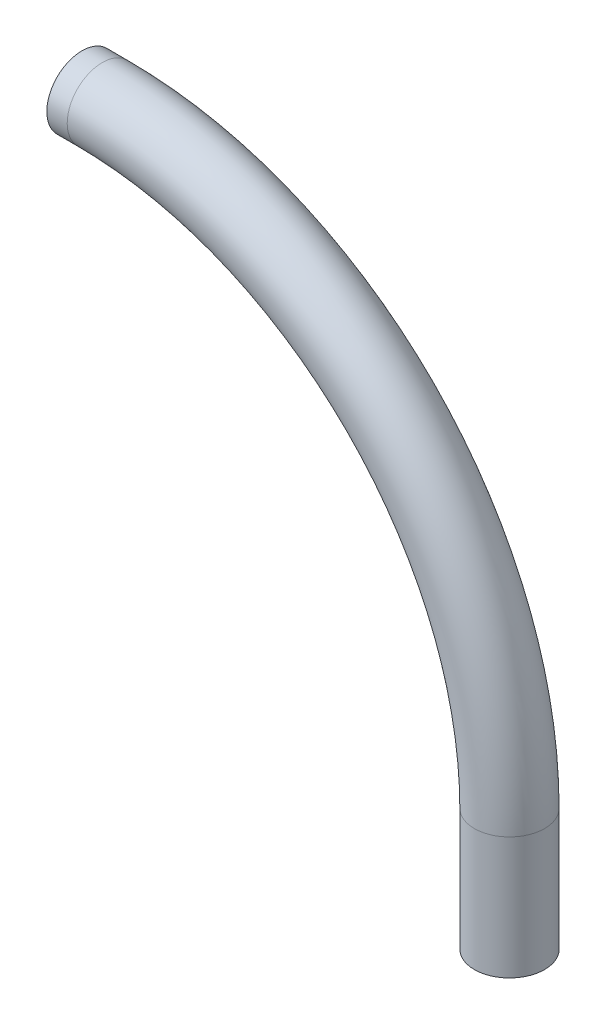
ISO-10303-21;
HEADER;
FILE_DESCRIPTION(('STEP AP214'),'2;1');
FILE_NAME('part.step','',(''),(''),'','','');
FILE_SCHEMA(('AUTOMOTIVE_DESIGN { 1 0 10303 214 1 1 1 1 }'));
ENDSEC;
DATA;
#1=APPLICATION_CONTEXT('core data for automotive mechanical design processes');
#2=APPLICATION_PROTOCOL_DEFINITION('international standard','automotive_design',2000,#1);
#3=PRODUCT_CONTEXT('',#1,'mechanical');
#4=PRODUCT('Part','Part','',(#3));
#5=PRODUCT_RELATED_PRODUCT_CATEGORY('part','',(#4));
#6=PRODUCT_DEFINITION_FORMATION('','',#4);
#7=PRODUCT_DEFINITION_CONTEXT('part definition',#1,'design');
#8=PRODUCT_DEFINITION('design','',#6,#7);
#9=PRODUCT_DEFINITION_SHAPE('','',#8);
#10=(LENGTH_UNIT() NAMED_UNIT(*) SI_UNIT(.MILLI.,.METRE.));
#11=(NAMED_UNIT(*) PLANE_ANGLE_UNIT() SI_UNIT($,.RADIAN.));
#12=(NAMED_UNIT(*) SI_UNIT($,.STERADIAN.) SOLID_ANGLE_UNIT());
#13=UNCERTAINTY_MEASURE_WITH_UNIT(LENGTH_MEASURE(1.E-05),#10,'distance_accuracy_value','');
#14=(GEOMETRIC_REPRESENTATION_CONTEXT(3) GLOBAL_UNCERTAINTY_ASSIGNED_CONTEXT((#13)) GLOBAL_UNIT_ASSIGNED_CONTEXT((#10,
#11,#12)) REPRESENTATION_CONTEXT('',''));
#15=CARTESIAN_POINT('',(0.,0.,0.));
#16=DIRECTION('',(0.,0.,1.));
#17=DIRECTION('',(1.,0.,0.));
#18=AXIS2_PLACEMENT_3D('',#15,#16,#17);
#19=CARTESIAN_POINT('',(-200.,60.,0.));
#20=DIRECTION('',(0.,0.,1.));
#21=DIRECTION('',(1.,0.,0.));
#22=AXIS2_PLACEMENT_3D('',#19,#20,#21);
#23=TOROIDAL_SURFACE('',#22,200.,14.5);
#24=CARTESIAN_POINT('',(0.,60.,0.));
#25=DIRECTION('',(0.,1.,0.));
#26=DIRECTION('',(0.,0.,1.));
#27=AXIS2_PLACEMENT_3D('',#24,#25,#26);
#28=CIRCLE('',#27,14.5);
#29=CARTESIAN_POINT('',(14.5,60.,0.));
#30=VERTEX_POINT('',#29);
#31=EDGE_CURVE('E31',#30,#30,#28,.F.);
#32=CARTESIAN_POINT('',(-200.,260.,0.));
#33=DIRECTION('',(-1.,0.,0.));
#34=DIRECTION('',(0.,-1.,0.));
#35=AXIS2_PLACEMENT_3D('',#32,#33,#34);
#36=CIRCLE('',#35,14.5);
#37=CARTESIAN_POINT('',(-200.,274.5,0.));
#38=VERTEX_POINT('',#37);
#39=EDGE_CURVE('E34',#38,#38,#36,.T.);
#40=CARTESIAN_POINT('',(-200.,60.,0.));
#41=DIRECTION('',(0.,0.,1.));
#42=DIRECTION('',(1.,0.,0.));
#43=AXIS2_PLACEMENT_3D('',#40,#41,#42);
#44=CIRCLE('',#43,214.5);
#45=EDGE_CURVE('',#30,#38,#44,.T.);
#46=ORIENTED_EDGE('',*,*,#31,.T.);
#47=ORIENTED_EDGE('',*,*,#39,.T.);
#48=ORIENTED_EDGE('',*,*,#45,.T.);
#49=ORIENTED_EDGE('',*,*,#45,.F.);
#50=EDGE_LOOP('',(#46,#48,#47,#49));
#51=FACE_BOUND('',#50,.T.);
#52=ADVANCED_FACE('F15',(#51),#23,.F.);
#53=CARTESIAN_POINT('',(-200.,260.,0.));
#54=DIRECTION('',(-1.,0.,0.));
#55=DIRECTION('',(0.,-1.,0.));
#56=AXIS2_PLACEMENT_3D('',#53,#54,#55);
#57=CYLINDRICAL_SURFACE('',#56,14.5);
#58=ORIENTED_EDGE('',*,*,#39,.F.);
#59=EDGE_LOOP('',(#58));
#60=FACE_BOUND('',#59,.T.);
#61=CARTESIAN_POINT('',(-210.,260.,0.));
#62=DIRECTION('',(-1.,0.,0.));
#63=DIRECTION('',(0.,-1.,0.));
#64=AXIS2_PLACEMENT_3D('',#61,#62,#63);
#65=CIRCLE('',#64,14.5);
#66=CARTESIAN_POINT('',(-210.,245.5,0.));
#67=VERTEX_POINT('',#66);
#68=EDGE_CURVE('E19',#67,#67,#65,.F.);
#69=ORIENTED_EDGE('',*,*,#68,.F.);
#70=EDGE_LOOP('',(#69));
#71=FACE_BOUND('',#70,.T.);
#72=ADVANCED_FACE('F51',(#60,#71),#57,.F.);
#73=CARTESIAN_POINT('',(0.,0.,0.));
#74=DIRECTION('',(0.,1.,0.));
#75=DIRECTION('',(0.,0.,1.));
#76=AXIS2_PLACEMENT_3D('',#73,#74,#75);
#77=CYLINDRICAL_SURFACE('',#76,14.5);
#78=ORIENTED_EDGE('',*,*,#31,.F.);
#79=EDGE_LOOP('',(#78));
#80=FACE_BOUND('',#79,.T.);
#81=CARTESIAN_POINT('',(0.,0.,0.));
#82=DIRECTION('',(0.,1.,0.));
#83=DIRECTION('',(0.,0.,1.));
#84=AXIS2_PLACEMENT_3D('',#81,#82,#83);
#85=CIRCLE('',#84,14.5);
#86=CARTESIAN_POINT('',(0.,0.,14.5));
#87=VERTEX_POINT('',#86);
#88=EDGE_CURVE('E41',#87,#87,#85,.F.);
#89=ORIENTED_EDGE('',*,*,#88,.T.);
#90=EDGE_LOOP('',(#89));
#91=FACE_BOUND('',#90,.T.);
#92=ADVANCED_FACE('F53',(#80,#91),#77,.F.);
#93=CARTESIAN_POINT('',(-210.,260.,0.));
#94=DIRECTION('',(-1.,0.,0.));
#95=DIRECTION('',(0.,-1.,0.));
#96=AXIS2_PLACEMENT_3D('',#93,#94,#95);
#97=PLANE('',#96);
#98=ORIENTED_EDGE('',*,*,#68,.T.);
#99=EDGE_LOOP('',(#98));
#100=FACE_BOUND('',#99,.T.);
#101=CARTESIAN_POINT('',(-210.,260.,0.));
#102=DIRECTION('',(-1.,0.,0.));
#103=DIRECTION('',(0.,-1.,0.));
#104=AXIS2_PLACEMENT_3D('',#101,#102,#103);
#105=CIRCLE('',#104,17.25);
#106=CARTESIAN_POINT('',(-210.,242.75,0.));
#107=VERTEX_POINT('',#106);
#108=EDGE_CURVE('E39',#107,#107,#105,.F.);
#109=ORIENTED_EDGE('',*,*,#108,.F.);
#110=EDGE_LOOP('',(#109));
#111=FACE_BOUND('',#110,.T.);
#112=ADVANCED_FACE('F48',(#100,#111),#97,.T.);
#113=CARTESIAN_POINT('',(0.,0.,0.));
#114=DIRECTION('',(0.,1.,0.));
#115=DIRECTION('',(0.,0.,1.));
#116=AXIS2_PLACEMENT_3D('',#113,#114,#115);
#117=PLANE('',#116);
#118=ORIENTED_EDGE('',*,*,#88,.F.);
#119=EDGE_LOOP('',(#118));
#120=FACE_BOUND('',#119,.T.);
#121=CARTESIAN_POINT('',(0.,0.,0.));
#122=DIRECTION('',(0.,1.,0.));
#123=DIRECTION('',(0.,0.,1.));
#124=AXIS2_PLACEMENT_3D('',#121,#122,#123);
#125=CIRCLE('',#124,17.25);
#126=CARTESIAN_POINT('',(0.,0.,17.25));
#127=VERTEX_POINT('',#126);
#128=EDGE_CURVE('E28',#127,#127,#125,.T.);
#129=ORIENTED_EDGE('',*,*,#128,.F.);
#130=EDGE_LOOP('',(#129));
#131=FACE_BOUND('',#130,.T.);
#132=ADVANCED_FACE('F78',(#120,#131),#117,.F.);
#133=CARTESIAN_POINT('',(-200.,260.,0.));
#134=DIRECTION('',(-1.,0.,0.));
#135=DIRECTION('',(0.,-1.,0.));
#136=AXIS2_PLACEMENT_3D('',#133,#134,#135);
#137=CYLINDRICAL_SURFACE('',#136,17.25);
#138=CARTESIAN_POINT('',(-200.,260.,0.));
#139=DIRECTION('',(1.,0.,0.));
#140=DIRECTION('',(0.,1.,0.));
#141=AXIS2_PLACEMENT_3D('',#138,#139,#140);
#142=CIRCLE('',#141,17.25);
#143=CARTESIAN_POINT('',(-200.,277.25,0.));
#144=VERTEX_POINT('',#143);
#145=EDGE_CURVE('E10',#144,#144,#142,.T.);
#146=ORIENTED_EDGE('',*,*,#145,.F.);
#147=EDGE_LOOP('',(#146));
#148=FACE_BOUND('',#147,.T.);
#149=ORIENTED_EDGE('',*,*,#108,.T.);
#150=EDGE_LOOP('',(#149));
#151=FACE_BOUND('',#150,.T.);
#152=ADVANCED_FACE('F70',(#148,#151),#137,.T.);
#153=CARTESIAN_POINT('',(0.,0.,0.));
#154=DIRECTION('',(0.,1.,0.));
#155=DIRECTION('',(0.,0.,1.));
#156=AXIS2_PLACEMENT_3D('',#153,#154,#155);
#157=CYLINDRICAL_SURFACE('',#156,17.25);
#158=CARTESIAN_POINT('',(0.,60.,0.));
#159=DIRECTION('',(0.,1.,0.));
#160=DIRECTION('',(1.,0.,0.));
#161=AXIS2_PLACEMENT_3D('',#158,#159,#160);
#162=CIRCLE('',#161,17.25);
#163=CARTESIAN_POINT('',(17.2500000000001,60.,0.));
#164=VERTEX_POINT('',#163);
#165=EDGE_CURVE('E23',#164,#164,#162,.T.);
#166=ORIENTED_EDGE('',*,*,#165,.F.);
#167=EDGE_LOOP('',(#166));
#168=FACE_BOUND('',#167,.T.);
#169=ORIENTED_EDGE('',*,*,#128,.T.);
#170=EDGE_LOOP('',(#169));
#171=FACE_BOUND('',#170,.T.);
#172=ADVANCED_FACE('F66',(#168,#171),#157,.T.);
#173=CARTESIAN_POINT('',(-200.,60.,0.));
#174=DIRECTION('',(0.,0.,1.));
#175=DIRECTION('',(1.,0.,0.));
#176=AXIS2_PLACEMENT_3D('',#173,#174,#175);
#177=TOROIDAL_SURFACE('',#176,200.,17.25);
#178=CARTESIAN_POINT('',(-200.,60.,0.));
#179=DIRECTION('',(0.,0.,1.));
#180=DIRECTION('',(1.,0.,0.));
#181=AXIS2_PLACEMENT_3D('',#178,#179,#180);
#182=CIRCLE('',#181,217.25);
#183=EDGE_CURVE('',#164,#144,#182,.T.);
#184=ORIENTED_EDGE('',*,*,#165,.T.);
#185=ORIENTED_EDGE('',*,*,#145,.T.);
#186=ORIENTED_EDGE('',*,*,#183,.T.);
#187=ORIENTED_EDGE('',*,*,#183,.F.);
#188=EDGE_LOOP('',(#184,#186,#185,#187));
#189=FACE_BOUND('',#188,.T.);
#190=ADVANCED_FACE('F17',(#189),#177,.T.);
#191=CLOSED_SHELL('',(#52,#72,#92,#112,#132,#152,#172,#190));
#192=MANIFOLD_SOLID_BREP('B1',#191);
#193=ADVANCED_BREP_SHAPE_REPRESENTATION('',(#18,#192),#14);
#194=SHAPE_DEFINITION_REPRESENTATION(#9,#193);
ENDSEC;
END-ISO-10303-21;
